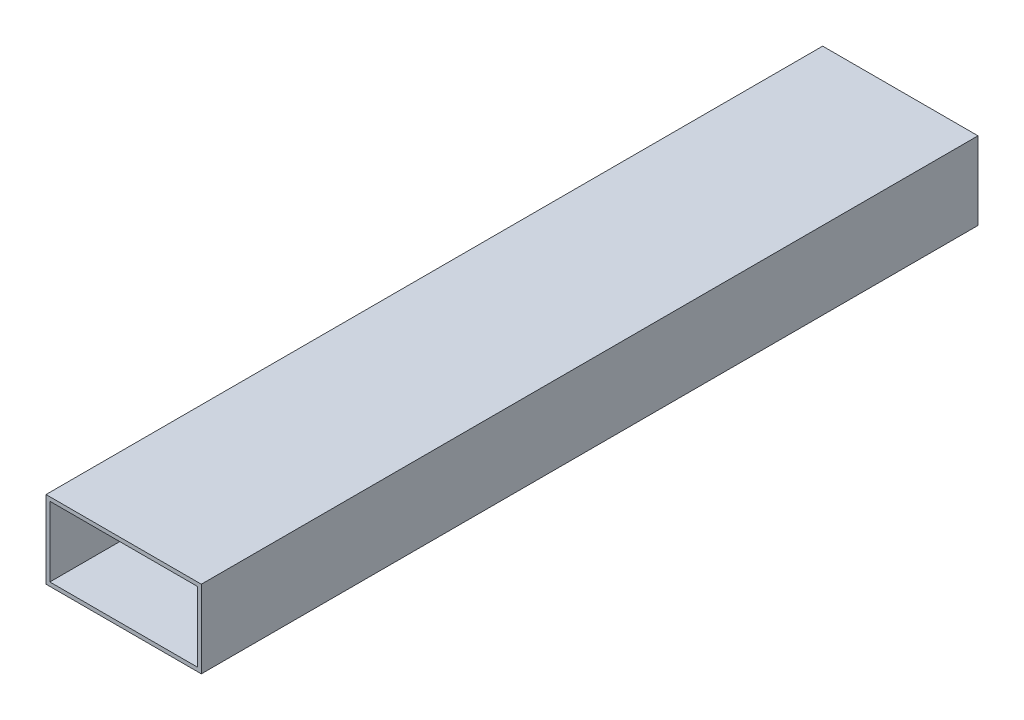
ISO-10303-21;
HEADER;
FILE_DESCRIPTION(('STEP AP214'),'2;1');
FILE_NAME('part.step','',(''),(''),'','','');
FILE_SCHEMA(('AUTOMOTIVE_DESIGN { 1 0 10303 214 1 1 1 1 }'));
ENDSEC;
DATA;
#1=APPLICATION_CONTEXT('core data for automotive mechanical design processes');
#2=APPLICATION_PROTOCOL_DEFINITION('international standard','automotive_design',2000,#1);
#3=PRODUCT_CONTEXT('',#1,'mechanical');
#4=PRODUCT('Part','Part','',(#3));
#5=PRODUCT_RELATED_PRODUCT_CATEGORY('part','',(#4));
#6=PRODUCT_DEFINITION_FORMATION('','',#4);
#7=PRODUCT_DEFINITION_CONTEXT('part definition',#1,'design');
#8=PRODUCT_DEFINITION('design','',#6,#7);
#9=PRODUCT_DEFINITION_SHAPE('','',#8);
#10=(LENGTH_UNIT() NAMED_UNIT(*) SI_UNIT(.MILLI.,.METRE.));
#11=(NAMED_UNIT(*) PLANE_ANGLE_UNIT() SI_UNIT($,.RADIAN.));
#12=(NAMED_UNIT(*) SI_UNIT($,.STERADIAN.) SOLID_ANGLE_UNIT());
#13=UNCERTAINTY_MEASURE_WITH_UNIT(LENGTH_MEASURE(1.E-05),#10,'distance_accuracy_value','');
#14=(GEOMETRIC_REPRESENTATION_CONTEXT(3) GLOBAL_UNCERTAINTY_ASSIGNED_CONTEXT((#13)) GLOBAL_UNIT_ASSIGNED_CONTEXT((#10,
#11,#12)) REPRESENTATION_CONTEXT('',''));
#15=CARTESIAN_POINT('',(0.,0.,0.));
#16=DIRECTION('',(0.,0.,1.));
#17=DIRECTION('',(1.,0.,0.));
#18=AXIS2_PLACEMENT_3D('',#15,#16,#17);
#19=CARTESIAN_POINT('',(0.,0.,400.));
#20=DIRECTION('',(0.,0.,1.));
#21=DIRECTION('',(1.,0.,0.));
#22=AXIS2_PLACEMENT_3D('',#19,#20,#21);
#23=PLANE('',#22);
#24=DIRECTION('',(0.,1.,0.));
#25=VECTOR('',#24,1.);
#26=CARTESIAN_POINT('',(40.,20.,400.));
#27=LINE('',#26,#25);
#28=CARTESIAN_POINT('',(40.,-20.,400.));
#29=VERTEX_POINT('',#28);
#30=CARTESIAN_POINT('',(40.,20.,400.));
#31=VERTEX_POINT('',#30);
#32=EDGE_CURVE('E134',#29,#31,#27,.T.);
#33=ORIENTED_EDGE('',*,*,#32,.T.);
#34=DIRECTION('',(-1.,0.,0.));
#35=VECTOR('',#34,1.);
#36=CARTESIAN_POINT('',(-40.,20.,400.));
#37=LINE('',#36,#35);
#38=CARTESIAN_POINT('',(-40.,20.,400.));
#39=VERTEX_POINT('',#38);
#40=EDGE_CURVE('E137',#31,#39,#37,.T.);
#41=ORIENTED_EDGE('',*,*,#40,.T.);
#42=DIRECTION('',(0.,-1.,0.));
#43=VECTOR('',#42,1.);
#44=CARTESIAN_POINT('',(-40.,20.,400.));
#45=LINE('',#44,#43);
#46=CARTESIAN_POINT('',(-40.,-20.,400.));
#47=VERTEX_POINT('',#46);
#48=EDGE_CURVE('E140',#39,#47,#45,.T.);
#49=ORIENTED_EDGE('',*,*,#48,.T.);
#50=DIRECTION('',(1.,0.,0.));
#51=VECTOR('',#50,1.);
#52=CARTESIAN_POINT('',(-40.,-20.,400.));
#53=LINE('',#52,#51);
#54=EDGE_CURVE('E142',#47,#29,#53,.T.);
#55=ORIENTED_EDGE('',*,*,#54,.T.);
#56=EDGE_LOOP('',(#33,#41,#49,#55));
#57=FACE_BOUND('',#56,.T.);
#58=DIRECTION('',(-1.,0.,0.));
#59=VECTOR('',#58,1.);
#60=CARTESIAN_POINT('',(-38.,18.,400.));
#61=LINE('',#60,#59);
#62=CARTESIAN_POINT('',(38.,18.,400.));
#63=VERTEX_POINT('',#62);
#64=CARTESIAN_POINT('',(-38.,18.,400.));
#65=VERTEX_POINT('',#64);
#66=EDGE_CURVE('E106',#63,#65,#61,.T.);
#67=ORIENTED_EDGE('',*,*,#66,.F.);
#68=DIRECTION('',(0.,1.,0.));
#69=VECTOR('',#68,1.);
#70=CARTESIAN_POINT('',(38.,18.,400.));
#71=LINE('',#70,#69);
#72=CARTESIAN_POINT('',(38.,-18.,400.));
#73=VERTEX_POINT('',#72);
#74=EDGE_CURVE('E98',#73,#63,#71,.T.);
#75=ORIENTED_EDGE('',*,*,#74,.F.);
#76=DIRECTION('',(1.,0.,0.));
#77=VECTOR('',#76,1.);
#78=CARTESIAN_POINT('',(-38.,-18.,400.));
#79=LINE('',#78,#77);
#80=CARTESIAN_POINT('',(-38.,-18.,400.));
#81=VERTEX_POINT('',#80);
#82=EDGE_CURVE('E120',#81,#73,#79,.T.);
#83=ORIENTED_EDGE('',*,*,#82,.F.);
#84=DIRECTION('',(0.,-1.,0.));
#85=VECTOR('',#84,1.);
#86=CARTESIAN_POINT('',(-38.,18.,400.));
#87=LINE('',#86,#85);
#88=EDGE_CURVE('E118',#65,#81,#87,.T.);
#89=ORIENTED_EDGE('',*,*,#88,.F.);
#90=EDGE_LOOP('',(#67,#75,#83,#89));
#91=FACE_BOUND('',#90,.T.);
#92=ADVANCED_FACE('F33',(#57,#91),#23,.T.);
#93=CARTESIAN_POINT('',(0.,0.,0.));
#94=DIRECTION('',(0.,0.,1.));
#95=DIRECTION('',(1.,0.,0.));
#96=AXIS2_PLACEMENT_3D('',#93,#94,#95);
#97=PLANE('',#96);
#98=DIRECTION('',(0.,1.,0.));
#99=VECTOR('',#98,1.);
#100=CARTESIAN_POINT('',(40.,20.,0.));
#101=LINE('',#100,#99);
#102=CARTESIAN_POINT('',(40.,-20.,0.));
#103=VERTEX_POINT('',#102);
#104=CARTESIAN_POINT('',(40.,20.,0.));
#105=VERTEX_POINT('',#104);
#106=EDGE_CURVE('E114',#103,#105,#101,.T.);
#107=ORIENTED_EDGE('',*,*,#106,.F.);
#108=DIRECTION('',(1.,0.,0.));
#109=VECTOR('',#108,1.);
#110=CARTESIAN_POINT('',(-40.,-20.,0.));
#111=LINE('',#110,#109);
#112=CARTESIAN_POINT('',(-40.,-20.,0.));
#113=VERTEX_POINT('',#112);
#114=EDGE_CURVE('E138',#113,#103,#111,.T.);
#115=ORIENTED_EDGE('',*,*,#114,.F.);
#116=DIRECTION('',(0.,-1.,0.));
#117=VECTOR('',#116,1.);
#118=CARTESIAN_POINT('',(-40.,20.,0.));
#119=LINE('',#118,#117);
#120=CARTESIAN_POINT('',(-40.,20.,0.));
#121=VERTEX_POINT('',#120);
#122=EDGE_CURVE('E149',#121,#113,#119,.T.);
#123=ORIENTED_EDGE('',*,*,#122,.F.);
#124=DIRECTION('',(-1.,0.,0.));
#125=VECTOR('',#124,1.);
#126=CARTESIAN_POINT('',(-40.,20.,0.));
#127=LINE('',#126,#125);
#128=EDGE_CURVE('E147',#105,#121,#127,.T.);
#129=ORIENTED_EDGE('',*,*,#128,.F.);
#130=EDGE_LOOP('',(#107,#115,#123,#129));
#131=FACE_BOUND('',#130,.T.);
#132=DIRECTION('',(0.,1.,0.));
#133=VECTOR('',#132,1.);
#134=CARTESIAN_POINT('',(38.,18.,0.));
#135=LINE('',#134,#133);
#136=CARTESIAN_POINT('',(38.,-18.,0.));
#137=VERTEX_POINT('',#136);
#138=CARTESIAN_POINT('',(38.,18.,0.));
#139=VERTEX_POINT('',#138);
#140=EDGE_CURVE('E56',#137,#139,#135,.T.);
#141=ORIENTED_EDGE('',*,*,#140,.T.);
#142=DIRECTION('',(-1.,0.,0.));
#143=VECTOR('',#142,1.);
#144=CARTESIAN_POINT('',(-38.,18.,0.));
#145=LINE('',#144,#143);
#146=CARTESIAN_POINT('',(-38.,18.,0.));
#147=VERTEX_POINT('',#146);
#148=EDGE_CURVE('E113',#139,#147,#145,.T.);
#149=ORIENTED_EDGE('',*,*,#148,.T.);
#150=DIRECTION('',(0.,-1.,0.));
#151=VECTOR('',#150,1.);
#152=CARTESIAN_POINT('',(-38.,18.,0.));
#153=LINE('',#152,#151);
#154=CARTESIAN_POINT('',(-38.,-18.,0.));
#155=VERTEX_POINT('',#154);
#156=EDGE_CURVE('E126',#147,#155,#153,.T.);
#157=ORIENTED_EDGE('',*,*,#156,.T.);
#158=DIRECTION('',(1.,0.,0.));
#159=VECTOR('',#158,1.);
#160=CARTESIAN_POINT('',(-38.,-18.,0.));
#161=LINE('',#160,#159);
#162=EDGE_CURVE('E107',#155,#137,#161,.T.);
#163=ORIENTED_EDGE('',*,*,#162,.T.);
#164=EDGE_LOOP('',(#141,#149,#157,#163));
#165=FACE_BOUND('',#164,.T.);
#166=ADVANCED_FACE('F167',(#131,#165),#97,.F.);
#167=CARTESIAN_POINT('',(40.,20.,400.));
#168=DIRECTION('',(-1.,0.,0.));
#169=DIRECTION('',(0.,-1.,0.));
#170=AXIS2_PLACEMENT_3D('',#167,#168,#169);
#171=PLANE('',#170);
#172=ORIENTED_EDGE('',*,*,#106,.T.);
#173=DIRECTION('',(0.,0.,-1.));
#174=VECTOR('',#173,1.);
#175=CARTESIAN_POINT('',(40.,20.,400.));
#176=LINE('',#175,#174);
#177=EDGE_CURVE('E11',#31,#105,#176,.T.);
#178=ORIENTED_EDGE('',*,*,#177,.F.);
#179=ORIENTED_EDGE('',*,*,#32,.F.);
#180=DIRECTION('',(0.,0.,-1.));
#181=VECTOR('',#180,1.);
#182=CARTESIAN_POINT('',(40.,-20.,400.));
#183=LINE('',#182,#181);
#184=EDGE_CURVE('E144',#29,#103,#183,.T.);
#185=ORIENTED_EDGE('',*,*,#184,.T.);
#186=EDGE_LOOP('',(#172,#178,#179,#185));
#187=FACE_BOUND('',#186,.T.);
#188=ADVANCED_FACE('F35',(#187),#171,.F.);
#189=CARTESIAN_POINT('',(-40.,20.,400.));
#190=DIRECTION('',(0.,-1.,0.));
#191=DIRECTION('',(0.,0.,-1.));
#192=AXIS2_PLACEMENT_3D('',#189,#190,#191);
#193=PLANE('',#192);
#194=ORIENTED_EDGE('',*,*,#128,.T.);
#195=DIRECTION('',(0.,0.,-1.));
#196=VECTOR('',#195,1.);
#197=CARTESIAN_POINT('',(-40.,20.,400.));
#198=LINE('',#197,#196);
#199=EDGE_CURVE('E41',#39,#121,#198,.T.);
#200=ORIENTED_EDGE('',*,*,#199,.F.);
#201=ORIENTED_EDGE('',*,*,#40,.F.);
#202=ORIENTED_EDGE('',*,*,#177,.T.);
#203=EDGE_LOOP('',(#194,#200,#201,#202));
#204=FACE_BOUND('',#203,.T.);
#205=ADVANCED_FACE('F177',(#204),#193,.F.);
#206=CARTESIAN_POINT('',(-40.,20.,400.));
#207=DIRECTION('',(1.,0.,0.));
#208=DIRECTION('',(0.,0.,-1.));
#209=AXIS2_PLACEMENT_3D('',#206,#207,#208);
#210=PLANE('',#209);
#211=ORIENTED_EDGE('',*,*,#122,.T.);
#212=DIRECTION('',(0.,0.,-1.));
#213=VECTOR('',#212,1.);
#214=CARTESIAN_POINT('',(-40.,-20.,400.));
#215=LINE('',#214,#213);
#216=EDGE_CURVE('E154',#47,#113,#215,.T.);
#217=ORIENTED_EDGE('',*,*,#216,.F.);
#218=ORIENTED_EDGE('',*,*,#48,.F.);
#219=ORIENTED_EDGE('',*,*,#199,.T.);
#220=EDGE_LOOP('',(#211,#217,#218,#219));
#221=FACE_BOUND('',#220,.T.);
#222=ADVANCED_FACE('F161',(#221),#210,.F.);
#223=CARTESIAN_POINT('',(-40.,-20.,400.));
#224=DIRECTION('',(0.,1.,0.));
#225=DIRECTION('',(0.,0.,1.));
#226=AXIS2_PLACEMENT_3D('',#223,#224,#225);
#227=PLANE('',#226);
#228=ORIENTED_EDGE('',*,*,#114,.T.);
#229=ORIENTED_EDGE('',*,*,#184,.F.);
#230=ORIENTED_EDGE('',*,*,#54,.F.);
#231=ORIENTED_EDGE('',*,*,#216,.T.);
#232=EDGE_LOOP('',(#228,#229,#230,#231));
#233=FACE_BOUND('',#232,.T.);
#234=ADVANCED_FACE('F171',(#233),#227,.F.);
#235=CARTESIAN_POINT('',(38.,18.,400.));
#236=DIRECTION('',(-1.,0.,0.));
#237=DIRECTION('',(0.,0.,1.));
#238=AXIS2_PLACEMENT_3D('',#235,#236,#237);
#239=PLANE('',#238);
#240=ORIENTED_EDGE('',*,*,#140,.F.);
#241=DIRECTION('',(0.,0.,-1.));
#242=VECTOR('',#241,1.);
#243=CARTESIAN_POINT('',(38.,-18.,400.));
#244=LINE('',#243,#242);
#245=EDGE_CURVE('E102',#73,#137,#244,.T.);
#246=ORIENTED_EDGE('',*,*,#245,.F.);
#247=ORIENTED_EDGE('',*,*,#74,.T.);
#248=DIRECTION('',(0.,0.,-1.));
#249=VECTOR('',#248,1.);
#250=CARTESIAN_POINT('',(38.,18.,400.));
#251=LINE('',#250,#249);
#252=EDGE_CURVE('E101',#63,#139,#251,.T.);
#253=ORIENTED_EDGE('',*,*,#252,.T.);
#254=EDGE_LOOP('',(#240,#246,#247,#253));
#255=FACE_BOUND('',#254,.T.);
#256=ADVANCED_FACE('F100',(#255),#239,.T.);
#257=CARTESIAN_POINT('',(-38.,18.,400.));
#258=DIRECTION('',(0.,-1.,0.));
#259=DIRECTION('',(0.,0.,-1.));
#260=AXIS2_PLACEMENT_3D('',#257,#258,#259);
#261=PLANE('',#260);
#262=ORIENTED_EDGE('',*,*,#148,.F.);
#263=ORIENTED_EDGE('',*,*,#252,.F.);
#264=ORIENTED_EDGE('',*,*,#66,.T.);
#265=DIRECTION('',(0.,0.,-1.));
#266=VECTOR('',#265,1.);
#267=CARTESIAN_POINT('',(-38.,18.,400.));
#268=LINE('',#267,#266);
#269=EDGE_CURVE('E115',#65,#147,#268,.T.);
#270=ORIENTED_EDGE('',*,*,#269,.T.);
#271=EDGE_LOOP('',(#262,#263,#264,#270));
#272=FACE_BOUND('',#271,.T.);
#273=ADVANCED_FACE('F110',(#272),#261,.T.);
#274=CARTESIAN_POINT('',(-38.,18.,400.));
#275=DIRECTION('',(1.,0.,0.));
#276=DIRECTION('',(0.,0.,-1.));
#277=AXIS2_PLACEMENT_3D('',#274,#275,#276);
#278=PLANE('',#277);
#279=ORIENTED_EDGE('',*,*,#156,.F.);
#280=ORIENTED_EDGE('',*,*,#269,.F.);
#281=ORIENTED_EDGE('',*,*,#88,.T.);
#282=DIRECTION('',(0.,0.,-1.));
#283=VECTOR('',#282,1.);
#284=CARTESIAN_POINT('',(-38.,-18.,400.));
#285=LINE('',#284,#283);
#286=EDGE_CURVE('E48',#81,#155,#285,.T.);
#287=ORIENTED_EDGE('',*,*,#286,.T.);
#288=EDGE_LOOP('',(#279,#280,#281,#287));
#289=FACE_BOUND('',#288,.T.);
#290=ADVANCED_FACE('F200',(#289),#278,.T.);
#291=CARTESIAN_POINT('',(-38.,-18.,400.));
#292=DIRECTION('',(0.,1.,0.));
#293=DIRECTION('',(0.,0.,1.));
#294=AXIS2_PLACEMENT_3D('',#291,#292,#293);
#295=PLANE('',#294);
#296=ORIENTED_EDGE('',*,*,#162,.F.);
#297=ORIENTED_EDGE('',*,*,#286,.F.);
#298=ORIENTED_EDGE('',*,*,#82,.T.);
#299=ORIENTED_EDGE('',*,*,#245,.T.);
#300=EDGE_LOOP('',(#296,#297,#298,#299));
#301=FACE_BOUND('',#300,.T.);
#302=ADVANCED_FACE('F204',(#301),#295,.T.);
#303=CLOSED_SHELL('',(#92,#166,#188,#205,#222,#234,#256,#273,#290,#302));
#304=MANIFOLD_SOLID_BREP('B2',#303);
#305=ADVANCED_BREP_SHAPE_REPRESENTATION('',(#18,#304),#14);
#306=SHAPE_DEFINITION_REPRESENTATION(#9,#305);
ENDSEC;
END-ISO-10303-21;
